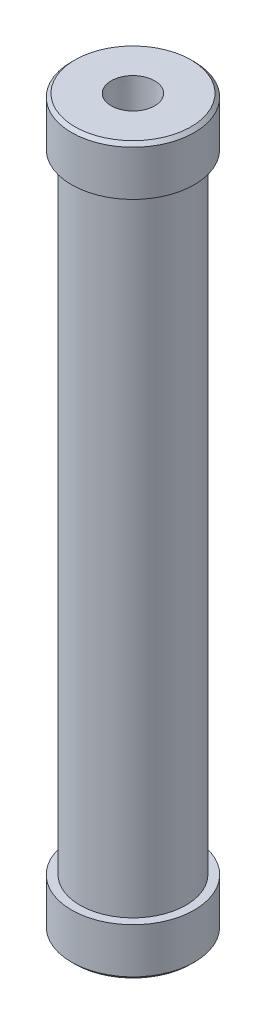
from build123d import *

# Parameters (mm, degrees)
SKETCH1_R           = 24.13
SKETCH1_R_2         = 20.32
BOSS_EXTRUDE1_DEPTH = 330.2
SKETCH2_R           = 27.94
BOSS_EXTRUDE2_DEPTH = 22.098
BOSS_EXTRUDE3_START = -22.098
SKETCH3_R           = 27.94
BOSS_EXTRUDE3_DEPTH = 22.098
CHAMFER1_SIZE       = 1.524


with BuildPart() as part:
    # Sketch1 → Boss-Extrude1 (new body)
    with BuildSketch(Plane(origin=(0, 0, 0), x_dir=(1, 0, 0), z_dir=(0, 1, 0))):
        with Locations(Location((0, 0, 0), (0, 0, 270))):
            Circle(SKETCH1_R)
        with Locations(Location((0, 0, 0), (0, 0, 270))):
            Circle(SKETCH1_R_2, mode=Mode.SUBTRACT)
    extrude(amount=BOSS_EXTRUDE1_DEPTH)

    # Sketch2 → Boss-Extrude2 (add)
    with BuildSketch(Plane(origin=(0, 0, 0), x_dir=(1, 0, 0), z_dir=(0, 1, 0))):
        with Locations(Location((0, 0, 0), (0, 0, 270))):
            Circle(SKETCH2_R)
    extrude(amount=BOSS_EXTRUDE2_DEPTH)

    # Sketch3 → Boss-Extrude3 (add)
    with BuildSketch(Plane(origin=(0, 330.2, 0), x_dir=(1, 0, 0), z_dir=(0, 1, 0)).offset(BOSS_EXTRUDE3_START)):
        with Locations(Location((0, 0, 0), (0, 0, 270))):
            Circle(SKETCH3_R)
    extrude(amount=BOSS_EXTRUDE3_DEPTH)

    # Sketch4 → 1_2 Rc Tapped Hole1 (revolve, cut)
    with BuildSketch(Plane(origin=(0, 330.2, 0), x_dir=(0, 0, 1), z_dir=(1, 0, 0))):
        Polygon((0, 0), (0, 29.387530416), (8.75, 24.13), (8.75, 14.986), (9.428250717, 14.986), (9.896063, 0), align=None)
    revolve(axis=Axis((0, 336.55, 0), (0, -1, 0)), mode=Mode.SUBTRACT)

    # Sketch6 → 1_2 Rc Tapped Hole2 (revolve, cut)
    with BuildSketch(Plane(origin=(0, 0, 0), x_dir=(0, 0, -1), z_dir=(1, 0, 0))):
        Polygon((0, 0), (0, 29.387530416), (8.75, 24.13), (8.75, 14.986), (9.428250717, 14.986), (9.896063, 0), align=None)
    revolve(axis=Axis((0, -6.35, 0), (0, 1, 0)), mode=Mode.SUBTRACT)

    # Chamfer1
    chamfer1_edges = [part.edges().sort_by_distance(p)[0] for p in [
        (0, 0, -27.94),
        (0, 330.2, -27.94),
    ]]
    chamfer(chamfer1_edges, length=CHAMFER1_SIZE)


solid = part.part
